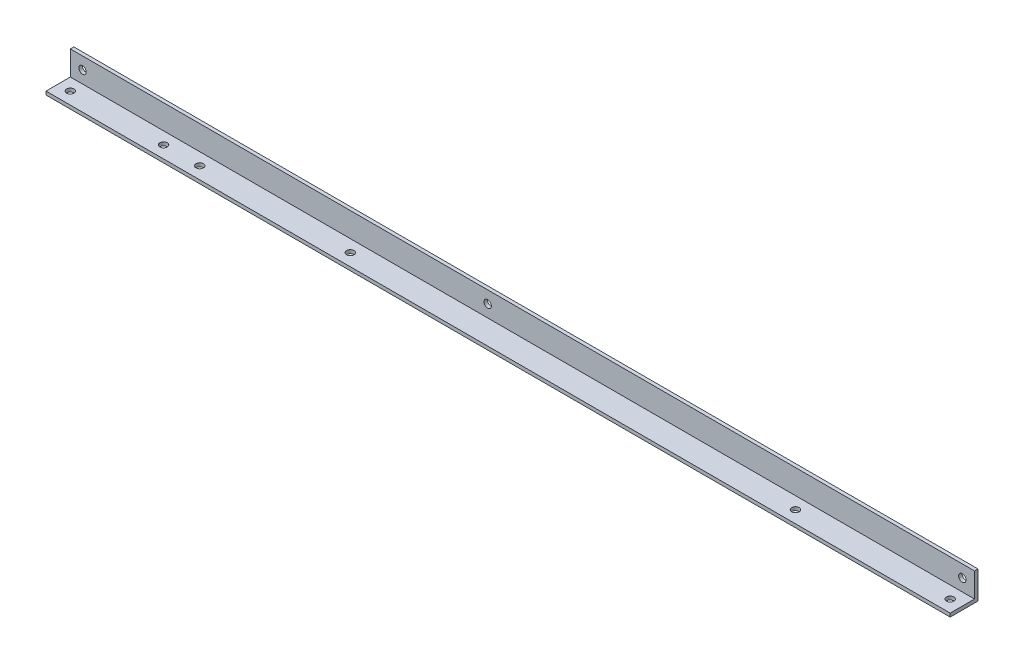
from build123d import *

# Parameters (mm, degrees)
SKETCH1_W           = 825.5
SKETCH1_H           = 25.4
BOSS_EXTRUDE1_DEPTH = 3.175
SKETCH2_W           = 825.5
SKETCH2_H           = 3.175
BOSS_EXTRUDE2_DEPTH = 22.225
SKETCH3_R           = 3.3782
CUT_EXTRUDE1_DEPTH  = 414.542988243
SKETCH4_R           = 3.3782
CUT_EXTRUDE2_DEPTH  = 415.127604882


with BuildPart() as part:
    # Sketch1 → Boss-Extrude1 (new body)
    with BuildSketch(Plane(origin=(0, 0, 0), x_dir=(1, 0, 0), z_dir=(0, 1, 0))):
        Rectangle(SKETCH1_W, SKETCH1_H)
    extrude(amount=BOSS_EXTRUDE1_DEPTH)

    # Sketch2 → Boss-Extrude2 (add)
    with BuildSketch(Plane(origin=(0, 3.175, 0), x_dir=(1, 0, 0), z_dir=(0, 1, 0))):
        with Locations((0, 11.1125)):
            Rectangle(SKETCH2_W, SKETCH2_H)
    extrude(amount=BOSS_EXTRUDE2_DEPTH)

    # Sketch3 → Cut-Extrude1 (cut, through all)
    with BuildSketch(Plane(origin=(0, 3.175, 0), x_dir=(1, 0, 0), z_dir=(0, 1, 0))):
        with Locations(Location((-401.6375, -1.5875, 0), (0, 0, 270))):
            Circle(SKETCH3_R)
        with Locations(Location((-316.5475, -1.5875, 0), (0, 0, 270))):
            Circle(SKETCH3_R)
        with Locations(Location((401.6375, -1.5875, 0), (0, 0, 270))):
            Circle(SKETCH3_R)
        with Locations(Location((260.35, -1.5875, 0), (0, 0, 270))):
            Circle(SKETCH3_R)
        with Locations(Location((-283.5275, -1.5875, 0), (0, 0, 270))):
            Circle(SKETCH3_R)
        with Locations(Location((-146.05, -1.5875, 0), (0, 0, 270))):
            Circle(SKETCH3_R)
    extrude(amount=-CUT_EXTRUDE1_DEPTH, mode=Mode.SUBTRACT)

    # Sketch4 → Cut-Extrude2 (cut, through all)
    with BuildSketch(Plane.XY.offset(-9.525)):
        with Locations((-401.6375, 14.2875)):
            Circle(SKETCH4_R)
        with Locations((401.6375, 14.2875)):
            Circle(SKETCH4_R)
        with Locations((-31.75, 14.2875)):
            Circle(SKETCH4_R)
    extrude(amount=-CUT_EXTRUDE2_DEPTH, mode=Mode.SUBTRACT)


solid = part.part
